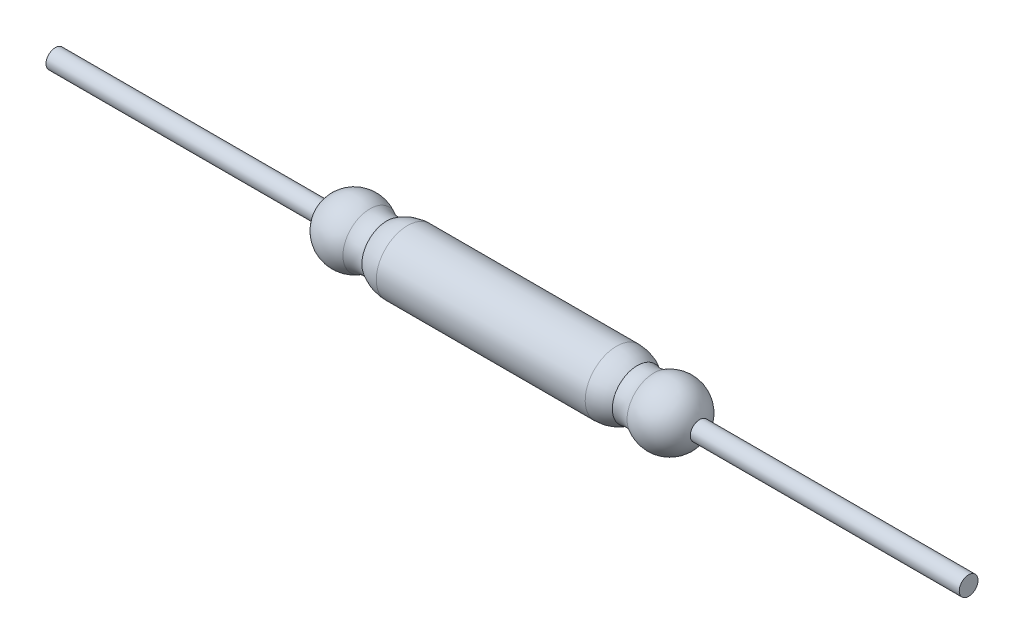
ISO-10303-21;
HEADER;
FILE_DESCRIPTION(('STEP AP214'),'2;1');
FILE_NAME('part.step','',(''),(''),'','','');
FILE_SCHEMA(('AUTOMOTIVE_DESIGN { 1 0 10303 214 1 1 1 1 }'));
ENDSEC;
DATA;
#1=APPLICATION_CONTEXT('core data for automotive mechanical design processes');
#2=APPLICATION_PROTOCOL_DEFINITION('international standard','automotive_design',2000,#1);
#3=PRODUCT_CONTEXT('',#1,'mechanical');
#4=PRODUCT('Part','Part','',(#3));
#5=PRODUCT_RELATED_PRODUCT_CATEGORY('part','',(#4));
#6=PRODUCT_DEFINITION_FORMATION('','',#4);
#7=PRODUCT_DEFINITION_CONTEXT('part definition',#1,'design');
#8=PRODUCT_DEFINITION('design','',#6,#7);
#9=PRODUCT_DEFINITION_SHAPE('','',#8);
#10=(LENGTH_UNIT() NAMED_UNIT(*) SI_UNIT(.MILLI.,.METRE.));
#11=(NAMED_UNIT(*) PLANE_ANGLE_UNIT() SI_UNIT($,.RADIAN.));
#12=(NAMED_UNIT(*) SI_UNIT($,.STERADIAN.) SOLID_ANGLE_UNIT());
#13=UNCERTAINTY_MEASURE_WITH_UNIT(LENGTH_MEASURE(1.E-05),#10,'distance_accuracy_value','');
#14=(GEOMETRIC_REPRESENTATION_CONTEXT(3) GLOBAL_UNCERTAINTY_ASSIGNED_CONTEXT((#13)) GLOBAL_UNIT_ASSIGNED_CONTEXT((#10,
#11,#12)) REPRESENTATION_CONTEXT('',''));
#15=CARTESIAN_POINT('',(0.,0.,0.));
#16=DIRECTION('',(0.,0.,1.));
#17=DIRECTION('',(1.,0.,0.));
#18=AXIS2_PLACEMENT_3D('',#15,#16,#17);
#19=CARTESIAN_POINT('',(28.5380462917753,0.,0.));
#20=DIRECTION('',(1.,0.,0.));
#21=DIRECTION('',(0.,1.,0.));
#22=AXIS2_PLACEMENT_3D('',#19,#20,#21);
#23=TOROIDAL_SURFACE('',#22,1.45631381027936,0.68664411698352);
#24=CARTESIAN_POINT('',(28.346908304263,0.,0.));
#25=DIRECTION('',(1.,0.,0.));
#26=DIRECTION('',(0.,1.,0.));
#27=AXIS2_PLACEMENT_3D('',#24,#25,#26);
#28=CIRCLE('',#27,0.796809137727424);
#29=CARTESIAN_POINT('',(28.346908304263,0.796809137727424,0.));
#30=VERTEX_POINT('',#29);
#31=EDGE_CURVE('E58',#30,#30,#28,.T.);
#32=ORIENTED_EDGE('',*,*,#31,.T.);
#33=EDGE_LOOP('',(#32));
#34=FACE_BOUND('',#33,.T.);
#35=CARTESIAN_POINT('',(28.884426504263,0.,0.));
#36=DIRECTION('',(1.,0.,0.));
#37=DIRECTION('',(0.,1.,0.));
#38=AXIS2_PLACEMENT_3D('',#35,#36,#37);
#39=CIRCLE('',#38,0.863438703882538);
#40=CARTESIAN_POINT('',(28.884426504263,0.863438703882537,0.));
#41=VERTEX_POINT('',#40);
#42=EDGE_CURVE('E10',#41,#41,#39,.T.);
#43=ORIENTED_EDGE('',*,*,#42,.F.);
#44=EDGE_LOOP('',(#43));
#45=FACE_BOUND('',#44,.T.);
#46=ADVANCED_FACE('F24',(#34,#45),#23,.F.);
#47=CARTESIAN_POINT('',(29.3888802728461,0.,0.));
#48=DIRECTION('',(1.,0.,0.));
#49=DIRECTION('',(0.,1.,0.));
#50=AXIS2_PLACEMENT_3D('',#47,#48,#49);
#51=SPHERICAL_SURFACE('',#50,1.);
#52=CARTESIAN_POINT('',(30.342819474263,0.,0.));
#53=DIRECTION('',(1.,0.,0.));
#54=DIRECTION('',(0.,1.,0.));
#55=AXIS2_PLACEMENT_3D('',#52,#53,#54);
#56=CIRCLE('',#55,0.3);
#57=CARTESIAN_POINT('',(30.342819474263,0.300000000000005,0.));
#58=VERTEX_POINT('',#57);
#59=EDGE_CURVE('E30',#58,#58,#56,.T.);
#60=CARTESIAN_POINT('',(28.884426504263,0.863438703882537,0.));
#61=CARTESIAN_POINT('',(28.9005694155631,0.872870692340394,0.));
#62=CARTESIAN_POINT('',(28.9169773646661,0.881848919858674,0.));
#63=CARTESIAN_POINT('',(28.9502705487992,0.898871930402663,0.));
#64=CARTESIAN_POINT('',(28.9671557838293,0.906916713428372,0.));
#65=CARTESIAN_POINT('',(29.0013507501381,0.92204691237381,0.));
#66=CARTESIAN_POINT('',(29.0186604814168,0.929132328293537,0.));
#67=CARTESIAN_POINT('',(29.0536499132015,0.942321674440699,0.));
#68=CARTESIAN_POINT('',(29.0713296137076,0.948425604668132,0.));
#69=CARTESIAN_POINT('',(29.1070034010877,0.959632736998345,0.));
#70=CARTESIAN_POINT('',(29.1249974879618,0.964735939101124,0.));
#71=CARTESIAN_POINT('',(29.1612434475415,0.973925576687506,0.));
#72=CARTESIAN_POINT('',(29.1794953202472,0.978012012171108,0.));
#73=CARTESIAN_POINT('',(29.2161994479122,0.98515526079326,0.));
#74=CARTESIAN_POINT('',(29.2346517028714,0.98821207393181,0.));
#75=CARTESIAN_POINT('',(29.271698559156,0.993286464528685,0.));
#76=CARTESIAN_POINT('',(29.2902931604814,0.995304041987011,0.));
#77=CARTESIAN_POINT('',(29.327566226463,0.998293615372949,0.));
#78=CARTESIAN_POINT('',(29.3462446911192,0.999265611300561,0.));
#79=CARTESIAN_POINT('',(29.3836267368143,1.00016096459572,0.));
#80=CARTESIAN_POINT('',(29.4023303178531,1.00008432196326,0.));
#81=CARTESIAN_POINT('',(29.4397037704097,0.998882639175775,0.));
#82=CARTESIAN_POINT('',(29.4583736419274,0.997757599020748,0.));
#83=CARTESIAN_POINT('',(29.4956209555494,0.994462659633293,0.));
#84=CARTESIAN_POINT('',(29.5141983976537,0.992292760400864,0.));
#85=CARTESIAN_POINT('',(29.5512024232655,0.986914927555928,0.));
#86=CARTESIAN_POINT('',(29.5696290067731,0.98370699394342,0.));
#87=CARTESIAN_POINT('',(29.6062733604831,0.976263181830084,0.));
#88=CARTESIAN_POINT('',(29.6244911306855,0.972027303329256,0.));
#89=CARTESIAN_POINT('',(29.66066055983,0.96254092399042,0.));
#90=CARTESIAN_POINT('',(29.6786122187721,0.957290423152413,0.));
#91=CARTESIAN_POINT('',(29.7141929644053,0.945791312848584,0.));
#92=CARTESIAN_POINT('',(29.7318220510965,0.939542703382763,0.));
#93=CARTESIAN_POINT('',(29.7667022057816,0.926067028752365,0.));
#94=CARTESIAN_POINT('',(29.7839532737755,0.918839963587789,0.));
#95=CARTESIAN_POINT('',(29.8180231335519,0.903430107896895,0.));
#96=CARTESIAN_POINT('',(29.8348419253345,0.895247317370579,0.));
#97=CARTESIAN_POINT('',(29.8679943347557,0.877951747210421,0.));
#98=CARTESIAN_POINT('',(29.8843279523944,0.868838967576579,0.));
#99=CARTESIAN_POINT('',(29.9164586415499,0.849712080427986,0.));
#100=CARTESIAN_POINT('',(29.9322557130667,0.839697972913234,0.));
#101=CARTESIAN_POINT('',(29.9632636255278,0.818799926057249,0.));
#102=CARTESIAN_POINT('',(29.9784744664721,0.807915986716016,0.));
#103=CARTESIAN_POINT('',(30.0082620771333,0.785312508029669,0.));
#104=CARTESIAN_POINT('',(30.02283884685,0.773592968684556,0.));
#105=CARTESIAN_POINT('',(30.0513124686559,0.749355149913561,0.));
#106=CARTESIAN_POINT('',(30.0652093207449,0.736836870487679,0.));
#107=CARTESIAN_POINT('',(30.0922793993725,0.711040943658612,0.));
#108=CARTESIAN_POINT('',(30.105452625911,0.697763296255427,0.));
#109=CARTESIAN_POINT('',(30.1310340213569,0.670490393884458,0.));
#110=CARTESIAN_POINT('',(30.1434421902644,0.656495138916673,0.));
#111=CARTESIAN_POINT('',(30.1674544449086,0.62783103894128,0.));
#112=CARTESIAN_POINT('',(30.1790585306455,0.613162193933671,0.));
#113=CARTESIAN_POINT('',(30.2014261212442,0.583197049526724,0.));
#114=CARTESIAN_POINT('',(30.2121896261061,0.567900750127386,0.));
#115=CARTESIAN_POINT('',(30.2328422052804,0.536728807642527,0.));
#116=CARTESIAN_POINT('',(30.2427312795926,0.520853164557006,0.));
#117=CARTESIAN_POINT('',(30.2616038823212,0.488572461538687,0.));
#118=CARTESIAN_POINT('',(30.2705874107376,0.472167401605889,0.));
#119=CARTESIAN_POINT('',(30.2876207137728,0.438879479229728,0.));
#120=CARTESIAN_POINT('',(30.2956704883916,0.421996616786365,0.));
#121=CARTESIAN_POINT('',(30.3108107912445,0.387806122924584,0.));
#122=CARTESIAN_POINT('',(30.3179013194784,0.370498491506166,0.));
#123=CARTESIAN_POINT('',(30.3311014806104,0.335513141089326,0.));
#124=CARTESIAN_POINT('',(30.3372111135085,0.317835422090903,0.));
#125=CARTESIAN_POINT('',(30.342819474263,0.300000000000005,0.));
#126=B_SPLINE_CURVE_WITH_KNOTS('',3,(#60,#61,#62,#63,#64,#65,#66,#67,#68,#69,#70,#71,#72,#73,
#74,#75,#76,#77,#78,#79,#80,#81,#82,#83,#84,#85,#86,#87,#88,#89,#90,#91,#92,#93,#94,#95,#96,#97,
#98,#99,#100,#101,#102,#103,#104,#105,#106,#107,#108,#109,#110,#111,#112,#113,#114,#115,#116,
#117,#118,#119,#120,#121,#122,#123,#124,#125),.UNSPECIFIED.,.F.,.F.,(4,2,2,2,2,2,2,2,2,2,2,2,2,
2,2,2,2,2,2,2,2,2,2,2,2,2,2,2,2,2,2,2,4),(0.,0.0560818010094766,0.112163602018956,
0.168245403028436,0.224327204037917,0.280409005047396,0.336490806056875,0.392572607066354,
0.448654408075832,0.504736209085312,0.560818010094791,0.616899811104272,0.67298161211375,
0.729063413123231,0.785145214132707,0.841227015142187,0.897308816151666,0.953390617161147,
1.00947241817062,1.0655542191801,1.12163602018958,1.17771782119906,1.23379962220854,
1.28988142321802,1.3459632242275,1.40204502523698,1.45812682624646,1.51420862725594,
1.57029042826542,1.6263722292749,1.68245403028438,1.73853583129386,1.79461763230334),.UNSPECIFIED.);
#127=EDGE_CURVE('BSEAM76',#41,#58,#126,.T.);
#128=ORIENTED_EDGE('',*,*,#42,.T.);
#129=ORIENTED_EDGE('',*,*,#59,.F.);
#130=ORIENTED_EDGE('',*,*,#127,.T.);
#131=ORIENTED_EDGE('',*,*,#127,.F.);
#132=EDGE_LOOP('',(#128,#130,#129,#131));
#133=FACE_BOUND('',#132,.T.);
#134=ADVANCED_FACE('F76',(#133),#51,.T.);
#135=CARTESIAN_POINT('',(38.9415321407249,0.,0.));
#136=DIRECTION('',(1.,0.,0.));
#137=DIRECTION('',(0.,1.,0.));
#138=AXIS2_PLACEMENT_3D('',#135,#136,#137);
#139=CYLINDRICAL_SURFACE('',#138,0.299999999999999);
#140=ORIENTED_EDGE('',*,*,#59,.T.);
#141=EDGE_LOOP('',(#140));
#142=FACE_BOUND('',#141,.T.);
#143=CARTESIAN_POINT('',(38.9415321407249,0.,0.));
#144=DIRECTION('',(1.,0.,0.));
#145=DIRECTION('',(0.,1.,0.));
#146=AXIS2_PLACEMENT_3D('',#143,#144,#145);
#147=CIRCLE('',#146,0.299999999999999);
#148=CARTESIAN_POINT('',(38.9415321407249,0.299999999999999,0.));
#149=VERTEX_POINT('',#148);
#150=EDGE_CURVE('E34',#149,#149,#147,.T.);
#151=ORIENTED_EDGE('',*,*,#150,.F.);
#152=EDGE_LOOP('',(#151));
#153=FACE_BOUND('',#152,.T.);
#154=ADVANCED_FACE('F80',(#142,#153),#139,.T.);
#155=CARTESIAN_POINT('',(38.9415321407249,0.299999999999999,0.));
#156=DIRECTION('',(1.,0.,0.));
#157=DIRECTION('',(0.,1.,0.));
#158=AXIS2_PLACEMENT_3D('',#155,#156,#157);
#159=PLANE('',#158);
#160=ORIENTED_EDGE('',*,*,#150,.T.);
#161=EDGE_LOOP('',(#160));
#162=FACE_BOUND('',#161,.T.);
#163=ADVANCED_FACE('F84',(#162),#159,.T.);
#164=CARTESIAN_POINT('',(9.74410680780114,0.299999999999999,0.));
#165=DIRECTION('',(-1.,0.,0.));
#166=DIRECTION('',(0.,-1.,0.));
#167=AXIS2_PLACEMENT_3D('',#164,#165,#166);
#168=PLANE('',#167);
#169=CARTESIAN_POINT('',(9.74410680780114,0.,0.));
#170=DIRECTION('',(1.,0.,0.));
#171=DIRECTION('',(0.,1.,0.));
#172=AXIS2_PLACEMENT_3D('',#169,#170,#171);
#173=CIRCLE('',#172,0.299999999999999);
#174=CARTESIAN_POINT('',(9.74410680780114,0.299999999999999,0.));
#175=VERTEX_POINT('',#174);
#176=EDGE_CURVE('E38',#175,#175,#173,.T.);
#177=ORIENTED_EDGE('',*,*,#176,.F.);
#178=EDGE_LOOP('',(#177));
#179=FACE_BOUND('',#178,.T.);
#180=ADVANCED_FACE('F90',(#179),#168,.T.);
#181=CARTESIAN_POINT('',(38.9415321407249,0.,0.));
#182=DIRECTION('',(1.,0.,0.));
#183=DIRECTION('',(0.,1.,0.));
#184=AXIS2_PLACEMENT_3D('',#181,#182,#183);
#185=CYLINDRICAL_SURFACE('',#184,0.299999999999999);
#186=ORIENTED_EDGE('',*,*,#176,.T.);
#187=EDGE_LOOP('',(#186));
#188=FACE_BOUND('',#187,.T.);
#189=CARTESIAN_POINT('',(18.342819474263,0.,0.));
#190=DIRECTION('',(1.,0.,0.));
#191=DIRECTION('',(0.,1.,0.));
#192=AXIS2_PLACEMENT_3D('',#189,#190,#191);
#193=CIRCLE('',#192,0.3);
#194=CARTESIAN_POINT('',(18.342819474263,0.299999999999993,0.));
#195=VERTEX_POINT('',#194);
#196=EDGE_CURVE('E43',#195,#195,#193,.T.);
#197=ORIENTED_EDGE('',*,*,#196,.F.);
#198=EDGE_LOOP('',(#197));
#199=FACE_BOUND('',#198,.T.);
#200=ADVANCED_FACE('F94',(#188,#199),#185,.T.);
#201=CARTESIAN_POINT('',(19.2967586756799,0.,0.));
#202=DIRECTION('',(1.,0.,0.));
#203=DIRECTION('',(0.,1.,0.));
#204=AXIS2_PLACEMENT_3D('',#201,#202,#203);
#205=SPHERICAL_SURFACE('',#204,1.);
#206=CARTESIAN_POINT('',(19.801212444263,0.,0.));
#207=DIRECTION('',(1.,0.,0.));
#208=DIRECTION('',(0.,1.,0.));
#209=AXIS2_PLACEMENT_3D('',#206,#207,#208);
#210=CIRCLE('',#209,0.863438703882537);
#211=CARTESIAN_POINT('',(19.801212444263,0.863438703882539,0.));
#212=VERTEX_POINT('',#211);
#213=EDGE_CURVE('E46',#212,#212,#210,.T.);
#214=CARTESIAN_POINT('',(18.342819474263,0.299999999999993,0.));
#215=CARTESIAN_POINT('',(18.3484278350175,0.317835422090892,0.));
#216=CARTESIAN_POINT('',(18.3545374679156,0.335513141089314,0.));
#217=CARTESIAN_POINT('',(18.3677376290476,0.370498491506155,0.));
#218=CARTESIAN_POINT('',(18.3748281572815,0.387806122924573,0.));
#219=CARTESIAN_POINT('',(18.3899684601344,0.421996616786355,0.));
#220=CARTESIAN_POINT('',(18.3980182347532,0.438879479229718,0.));
#221=CARTESIAN_POINT('',(18.4150515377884,0.472167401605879,0.));
#222=CARTESIAN_POINT('',(18.4240350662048,0.488572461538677,0.));
#223=CARTESIAN_POINT('',(18.4429076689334,0.520853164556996,0.));
#224=CARTESIAN_POINT('',(18.4527967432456,0.536728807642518,0.));
#225=CARTESIAN_POINT('',(18.4734493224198,0.567900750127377,0.));
#226=CARTESIAN_POINT('',(18.4842128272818,0.583197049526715,0.));
#227=CARTESIAN_POINT('',(18.5065804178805,0.613162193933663,0.));
#228=CARTESIAN_POINT('',(18.5181845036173,0.627831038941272,0.));
#229=CARTESIAN_POINT('',(18.5421967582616,0.656495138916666,0.));
#230=CARTESIAN_POINT('',(18.554604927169,0.67049039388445,0.));
#231=CARTESIAN_POINT('',(18.580186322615,0.69776329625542,0.));
#232=CARTESIAN_POINT('',(18.5933595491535,0.711040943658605,0.));
#233=CARTESIAN_POINT('',(18.6204296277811,0.736836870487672,0.));
#234=CARTESIAN_POINT('',(18.6343264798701,0.749355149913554,0.));
#235=CARTESIAN_POINT('',(18.6628001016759,0.77359296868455,0.));
#236=CARTESIAN_POINT('',(18.6773768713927,0.785312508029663,0.));
#237=CARTESIAN_POINT('',(18.7071644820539,0.80791598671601,0.));
#238=CARTESIAN_POINT('',(18.7223753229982,0.818799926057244,0.));
#239=CARTESIAN_POINT('',(18.7533832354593,0.839697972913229,0.));
#240=CARTESIAN_POINT('',(18.7691803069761,0.849712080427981,0.));
#241=CARTESIAN_POINT('',(18.8013109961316,0.868838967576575,0.));
#242=CARTESIAN_POINT('',(18.8176446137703,0.877951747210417,0.));
#243=CARTESIAN_POINT('',(18.8507970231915,0.895247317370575,0.));
#244=CARTESIAN_POINT('',(18.8676158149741,0.903430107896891,0.));
#245=CARTESIAN_POINT('',(18.9016856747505,0.918839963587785,0.));
#246=CARTESIAN_POINT('',(18.9189367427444,0.926067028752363,0.));
#247=CARTESIAN_POINT('',(18.9538168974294,0.939542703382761,0.));
#248=CARTESIAN_POINT('',(18.9714459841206,0.945791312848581,0.));
#249=CARTESIAN_POINT('',(19.0070267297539,0.95729042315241,0.));
#250=CARTESIAN_POINT('',(19.024978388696,0.962540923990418,0.));
#251=CARTESIAN_POINT('',(19.0611478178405,0.972027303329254,0.));
#252=CARTESIAN_POINT('',(19.0793655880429,0.976263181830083,0.));
#253=CARTESIAN_POINT('',(19.1160099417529,0.983706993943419,0.));
#254=CARTESIAN_POINT('',(19.1344365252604,0.986914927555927,0.));
#255=CARTESIAN_POINT('',(19.1714405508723,0.992292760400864,0.));
#256=CARTESIAN_POINT('',(19.1900179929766,0.994462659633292,0.));
#257=CARTESIAN_POINT('',(19.2272653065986,0.997757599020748,0.));
#258=CARTESIAN_POINT('',(19.2459351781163,0.998882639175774,0.));
#259=CARTESIAN_POINT('',(19.2833086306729,1.00008432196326,0.));
#260=CARTESIAN_POINT('',(19.3020122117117,1.00016096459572,0.));
#261=CARTESIAN_POINT('',(19.3393942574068,0.999265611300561,0.));
#262=CARTESIAN_POINT('',(19.358072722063,0.998293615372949,0.));
#263=CARTESIAN_POINT('',(19.3953457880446,0.995304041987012,0.));
#264=CARTESIAN_POINT('',(19.41394038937,0.993286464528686,0.));
#265=CARTESIAN_POINT('',(19.4509872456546,0.988212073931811,0.));
#266=CARTESIAN_POINT('',(19.4694395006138,0.985155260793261,0.));
#267=CARTESIAN_POINT('',(19.5061436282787,0.978012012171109,0.));
#268=CARTESIAN_POINT('',(19.5243955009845,0.973925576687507,0.));
#269=CARTESIAN_POINT('',(19.5606414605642,0.964735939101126,0.));
#270=CARTESIAN_POINT('',(19.5786355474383,0.959632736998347,0.));
#271=CARTESIAN_POINT('',(19.6143093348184,0.948425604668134,0.));
#272=CARTESIAN_POINT('',(19.6319890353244,0.9423216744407,0.));
#273=CARTESIAN_POINT('',(19.6669784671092,0.929132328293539,0.));
#274=CARTESIAN_POINT('',(19.6842881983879,0.922046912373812,0.));
#275=CARTESIAN_POINT('',(19.7184831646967,0.906916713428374,0.));
#276=CARTESIAN_POINT('',(19.7353683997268,0.898871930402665,0.));
#277=CARTESIAN_POINT('',(19.7686615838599,0.881848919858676,0.));
#278=CARTESIAN_POINT('',(19.7850695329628,0.872870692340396,0.));
#279=CARTESIAN_POINT('',(19.801212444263,0.863438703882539,0.));
#280=B_SPLINE_CURVE_WITH_KNOTS('',3,(#214,#215,#216,#217,#218,#219,#220,#221,#222,#223,#224,
#225,#226,#227,#228,#229,#230,#231,#232,#233,#234,#235,#236,#237,#238,#239,#240,#241,#242,#243,
#244,#245,#246,#247,#248,#249,#250,#251,#252,#253,#254,#255,#256,#257,#258,#259,#260,#261,#262,
#263,#264,#265,#266,#267,#268,#269,#270,#271,#272,#273,#274,#275,#276,#277,#278,#279),
.UNSPECIFIED.,.F.,.F.,(4,2,2,2,2,2,2,2,2,2,2,2,2,2,2,2,2,2,2,2,2,2,2,2,2,2,2,2,2,2,2,2,4),(0.,
0.0560818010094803,0.112163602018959,0.168245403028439,0.224327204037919,0.280409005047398,
0.336490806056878,0.392572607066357,0.448654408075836,0.504736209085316,0.560818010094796,
0.616899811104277,0.672981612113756,0.729063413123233,0.785145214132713,0.841227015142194,
0.897308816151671,0.953390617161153,1.00947241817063,1.06555421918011,1.12163602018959,
1.17771782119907,1.23379962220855,1.28988142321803,1.34596322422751,1.40204502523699,
1.45812682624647,1.51420862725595,1.57029042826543,1.62637222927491,1.68245403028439,
1.73853583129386,1.79461763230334),.UNSPECIFIED.);
#281=EDGE_CURVE('BSEAM98',#195,#212,#280,.T.);
#282=ORIENTED_EDGE('',*,*,#196,.T.);
#283=ORIENTED_EDGE('',*,*,#213,.F.);
#284=ORIENTED_EDGE('',*,*,#281,.T.);
#285=ORIENTED_EDGE('',*,*,#281,.F.);
#286=EDGE_LOOP('',(#282,#284,#283,#285));
#287=FACE_BOUND('',#286,.T.);
#288=ADVANCED_FACE('F98',(#287),#205,.T.);
#289=CARTESIAN_POINT('',(20.1475926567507,0.,0.));
#290=DIRECTION('',(1.,0.,0.));
#291=DIRECTION('',(0.,1.,0.));
#292=AXIS2_PLACEMENT_3D('',#289,#290,#291);
#293=TOROIDAL_SURFACE('',#292,1.45631381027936,0.68664411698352);
#294=ORIENTED_EDGE('',*,*,#213,.T.);
#295=EDGE_LOOP('',(#294));
#296=FACE_BOUND('',#295,.T.);
#297=CARTESIAN_POINT('',(20.338730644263,0.,0.));
#298=DIRECTION('',(1.,0.,0.));
#299=DIRECTION('',(0.,1.,0.));
#300=AXIS2_PLACEMENT_3D('',#297,#298,#299);
#301=CIRCLE('',#300,0.796809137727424);
#302=CARTESIAN_POINT('',(20.338730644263,0.796809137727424,0.));
#303=VERTEX_POINT('',#302);
#304=EDGE_CURVE('E49',#303,#303,#301,.T.);
#305=ORIENTED_EDGE('',*,*,#304,.F.);
#306=EDGE_LOOP('',(#305));
#307=FACE_BOUND('',#306,.T.);
#308=ADVANCED_FACE('F102',(#296,#307),#293,.F.);
#309=CARTESIAN_POINT('',(21.002542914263,0.,0.));
#310=DIRECTION('',(1.,0.,0.));
#311=DIRECTION('',(0.,1.,0.));
#312=AXIS2_PLACEMENT_3D('',#309,#310,#311);
#313=DEGENERATE_TOROIDAL_SURFACE('',#312,0.185912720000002,1.18591272,.F.);
#314=ORIENTED_EDGE('',*,*,#304,.T.);
#315=EDGE_LOOP('',(#314));
#316=FACE_BOUND('',#315,.T.);
#317=CARTESIAN_POINT('',(21.002542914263,0.,0.));
#318=DIRECTION('',(1.,0.,0.));
#319=DIRECTION('',(0.,1.,0.));
#320=AXIS2_PLACEMENT_3D('',#317,#318,#319);
#321=CIRCLE('',#320,0.999999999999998);
#322=CARTESIAN_POINT('',(21.002542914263,0.999999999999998,0.));
#323=VERTEX_POINT('',#322);
#324=EDGE_CURVE('E52',#323,#323,#321,.T.);
#325=ORIENTED_EDGE('',*,*,#324,.F.);
#326=EDGE_LOOP('',(#325));
#327=FACE_BOUND('',#326,.T.);
#328=ADVANCED_FACE('F72',(#316,#327),#313,.F.);
#329=CARTESIAN_POINT('',(38.9415321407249,0.,0.));
#330=DIRECTION('',(1.,0.,0.));
#331=DIRECTION('',(0.,1.,0.));
#332=AXIS2_PLACEMENT_3D('',#329,#330,#331);
#333=CYLINDRICAL_SURFACE('',#332,0.999999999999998);
#334=ORIENTED_EDGE('',*,*,#324,.T.);
#335=EDGE_LOOP('',(#334));
#336=FACE_BOUND('',#335,.T.);
#337=CARTESIAN_POINT('',(27.683096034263,0.,0.));
#338=DIRECTION('',(1.,0.,0.));
#339=DIRECTION('',(0.,1.,0.));
#340=AXIS2_PLACEMENT_3D('',#337,#338,#339);
#341=CIRCLE('',#340,0.999999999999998);
#342=CARTESIAN_POINT('',(27.683096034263,0.999999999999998,0.));
#343=VERTEX_POINT('',#342);
#344=EDGE_CURVE('E55',#343,#343,#341,.T.);
#345=ORIENTED_EDGE('',*,*,#344,.F.);
#346=EDGE_LOOP('',(#345));
#347=FACE_BOUND('',#346,.T.);
#348=ADVANCED_FACE('F66',(#336,#347),#333,.T.);
#349=CARTESIAN_POINT('',(27.683096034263,0.,0.));
#350=DIRECTION('',(1.,0.,0.));
#351=DIRECTION('',(0.,1.,0.));
#352=AXIS2_PLACEMENT_3D('',#349,#350,#351);
#353=DEGENERATE_TOROIDAL_SURFACE('',#352,0.185912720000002,1.18591272,.F.);
#354=ORIENTED_EDGE('',*,*,#344,.T.);
#355=EDGE_LOOP('',(#354));
#356=FACE_BOUND('',#355,.T.);
#357=ORIENTED_EDGE('',*,*,#31,.F.);
#358=EDGE_LOOP('',(#357));
#359=FACE_BOUND('',#358,.T.);
#360=ADVANCED_FACE('F64',(#356,#359),#353,.F.);
#361=CLOSED_SHELL('',(#46,#134,#154,#163,#180,#200,#288,#308,#328,#348,#360));
#362=MANIFOLD_SOLID_BREP('B2',#361);
#363=ADVANCED_BREP_SHAPE_REPRESENTATION('',(#18,#362),#14);
#364=SHAPE_DEFINITION_REPRESENTATION(#9,#363);
ENDSEC;
END-ISO-10303-21;
